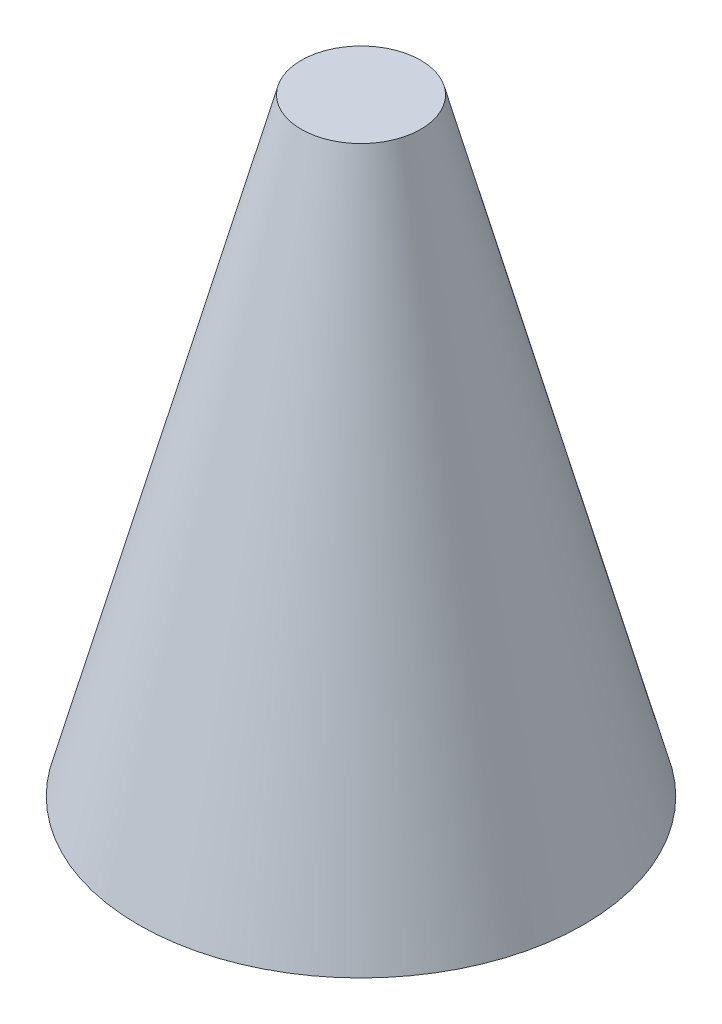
from build123d import *


with BuildPart() as part:
    # Sketch1 → Revolve1 (revolve)
    with BuildSketch(Plane.XY, mode=Mode.PRIVATE) as revolve1_sk:
        Polygon((0, 0), (-37.5, 0), (-139.588642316, -381), (0, -381), align=None)
    revolve(revolve1_sk.sketch.rotate(Axis((0, -381, 0), (0, 1, 0)), 270), axis=Axis((0, -381, 0), (0, 1, 0)))

    # Sketch2 → Cut-Revolve1 (revolve, cut)
    with BuildSketch(Plane.XY, mode=Mode.PRIVATE) as cut_revolve1_sk:
        Polygon((0, -381), (-63.388642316, -381), (0, -65.308179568), align=None)
    revolve(cut_revolve1_sk.sketch.rotate(Axis((0, -65.308179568, 0), (0, -1, 0)), 180), axis=Axis((0, -65.308179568, 0), (0, -1, 0)), mode=Mode.SUBTRACT)


solid = part.part
